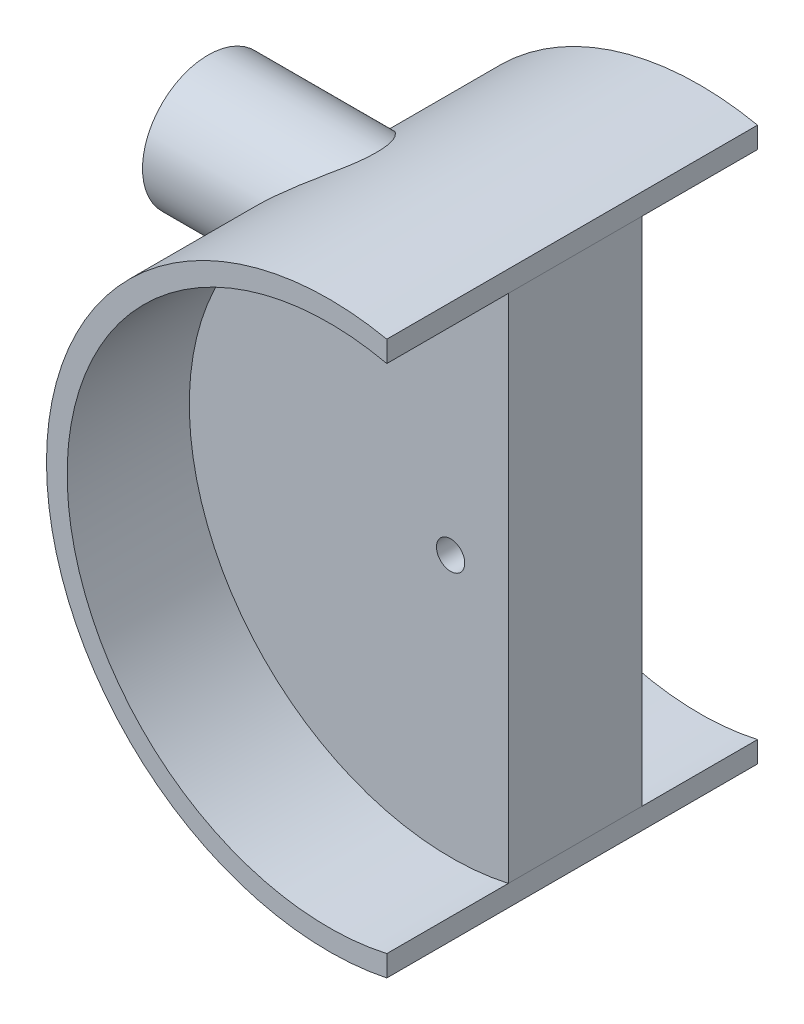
from build123d import *

# Parameters (mm, degrees)
BOSS_EXTRUDE1_DEPTH = 38.735
BOSS_EXTRUDE2_DEPTH = 13.97
SKETCH2_R           = 1.476232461
CUT_EXTRUDE1_DEPTH  = 50.209427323
SKETCH4_R           = 6.858
BOSS_EXTRUDE7_DEPTH = 38.354
SKETCH6_R           = 3.4925
CUT_EXTRUDE2_DEPTH  = 19.304


with BuildPart() as part:
    # Sketch1 → Boss-Extrude1 (new body)
    with BuildSketch(Plane.XY):
        with BuildLine():
            Line((6.0325, 28.904708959), (6.0325, 26.695387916))
            ThreePointArc((6.0325, 26.695387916), (-27.3685, 0), (6.0325, -26.695387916))
            Line((6.0325, -26.695387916), (6.0325, -28.904708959))
            ThreePointArc((6.0325, -28.904708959), (-29.5275, 0), (6.0325, 28.904708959))
        make_face()
    extrude(amount=BOSS_EXTRUDE1_DEPTH)


with BuildPart() as body_2:
    # 3DSketch1 → Boss-Extrude2 (new body)
    with BuildSketch(Plane(origin=(6.0325, 26.695387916, 26.035), x_dir=(0, -1, 0), z_dir=(0, 0, -1))):
        with BuildLine():
            Line((0, 0), (53.390775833, 0))
            ThreePointArc((53.390775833, 0), (26.695387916, 33.33512537), (0, 0))
        make_face()
    extrude(amount=BOSS_EXTRUDE2_DEPTH)

    # Sketch2 → Cut-Extrude1 (cut, through all)
    with BuildSketch(Plane.XY.offset(26.035)):
        Circle(SKETCH2_R)
    extrude(amount=-CUT_EXTRUDE1_DEPTH, mode=Mode.SUBTRACT)


with BuildPart() as body_3:
    # Sketch4 → Boss-Extrude7 (new body)
    with BuildSketch(Plane(origin=(6.0325, 0, 0), x_dir=(0, 0, -1), z_dir=(1, 0, 0))):
        with Locations((-19.05, 18.744708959)):
            Circle(SKETCH4_R)
    extrude(amount=-BOSS_EXTRUDE7_DEPTH)


with BuildPart() as cut_extrude2_tool:
    # Sketch6 → Cut-Extrude2 (new body)
    with BuildSketch(Plane.ZY.offset(32.3215)):
        with Locations((19.05, 18.744708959)):
            Circle(SKETCH6_R)
    extrude(amount=-CUT_EXTRUDE2_DEPTH)


with BuildPart() as part_1:
    add(part.part)

    # Cut-Extrude2: cut by cut_extrude2_tool
    add(cut_extrude2_tool.part, mode=Mode.SUBTRACT)


with BuildPart() as body_2_1:
    add(body_2.part)

    # Cut-Extrude2: cut by cut_extrude2_tool
    add(cut_extrude2_tool.part, mode=Mode.SUBTRACT)


with BuildPart() as body_3_1:
    add(body_3.part)

    # Cut-Extrude2: cut by cut_extrude2_tool
    add(cut_extrude2_tool.part, mode=Mode.SUBTRACT)


solid = Compound([part_1.part, body_2_1.part, body_3_1.part])
